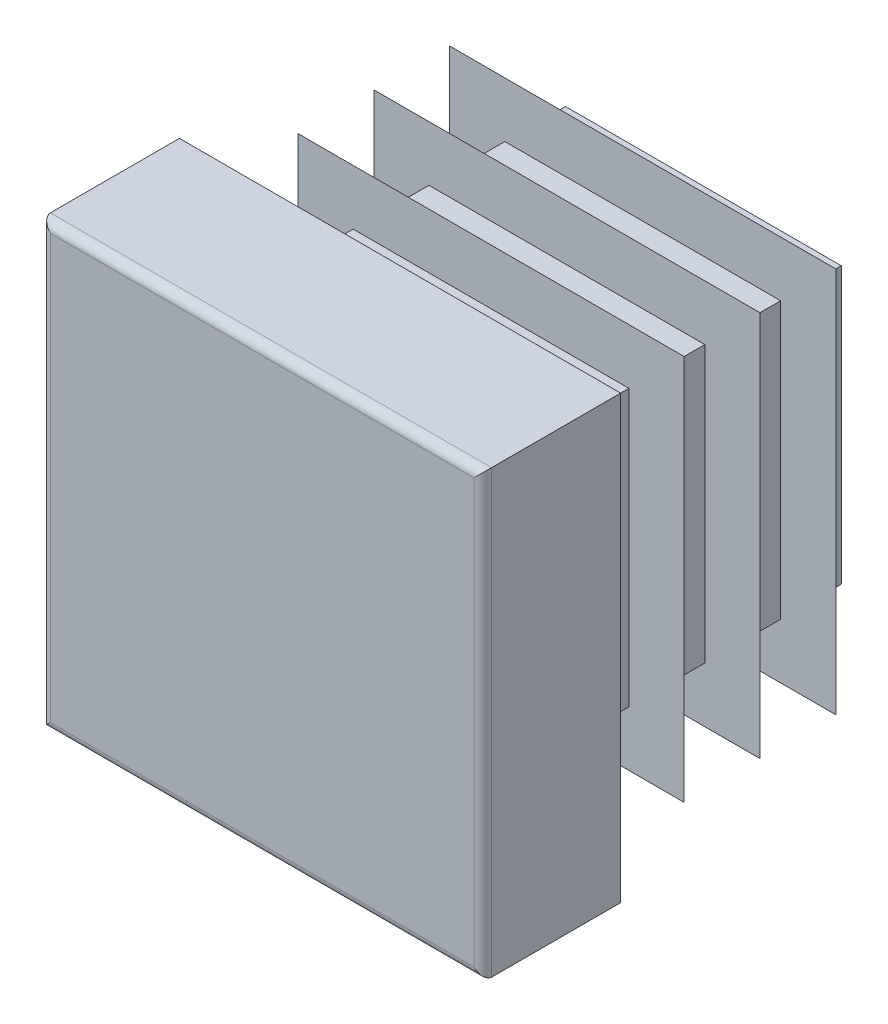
ISO-10303-21;
HEADER;
FILE_DESCRIPTION(('STEP AP214'),'2;1');
FILE_NAME('part.step','',(''),(''),'','','');
FILE_SCHEMA(('AUTOMOTIVE_DESIGN { 1 0 10303 214 1 1 1 1 }'));
ENDSEC;
DATA;
#1=APPLICATION_CONTEXT('core data for automotive mechanical design processes');
#2=APPLICATION_PROTOCOL_DEFINITION('international standard','automotive_design',2000,#1);
#3=PRODUCT_CONTEXT('',#1,'mechanical');
#4=PRODUCT('Part','Part','',(#3));
#5=PRODUCT_RELATED_PRODUCT_CATEGORY('part','',(#4));
#6=PRODUCT_DEFINITION_FORMATION('','',#4);
#7=PRODUCT_DEFINITION_CONTEXT('part definition',#1,'design');
#8=PRODUCT_DEFINITION('design','',#6,#7);
#9=PRODUCT_DEFINITION_SHAPE('','',#8);
#10=(LENGTH_UNIT() NAMED_UNIT(*) SI_UNIT(.MILLI.,.METRE.));
#11=(NAMED_UNIT(*) PLANE_ANGLE_UNIT() SI_UNIT($,.RADIAN.));
#12=(NAMED_UNIT(*) SI_UNIT($,.STERADIAN.) SOLID_ANGLE_UNIT());
#13=UNCERTAINTY_MEASURE_WITH_UNIT(LENGTH_MEASURE(1.E-05),#10,'distance_accuracy_value','');
#14=(GEOMETRIC_REPRESENTATION_CONTEXT(3) GLOBAL_UNCERTAINTY_ASSIGNED_CONTEXT((#13)) GLOBAL_UNIT_ASSIGNED_CONTEXT((#10,
#11,#12)) REPRESENTATION_CONTEXT('',''));
#15=CARTESIAN_POINT('',(0.,0.,0.));
#16=DIRECTION('',(0.,0.,1.));
#17=DIRECTION('',(1.,0.,0.));
#18=AXIS2_PLACEMENT_3D('',#15,#16,#17);
#19=CARTESIAN_POINT('',(7.68,-8.,5.));
#20=DIRECTION('',(0.,0.,-1.));
#21=DIRECTION('',(0.,1.,0.));
#22=AXIS2_PLACEMENT_3D('',#19,#20,#21);
#23=PLANE('',#22);
#24=DIRECTION('',(0.,1.,0.));
#25=VECTOR('',#24,1.);
#26=CARTESIAN_POINT('',(-7.68,-8.,5.));
#27=LINE('',#26,#25);
#28=CARTESIAN_POINT('',(-7.68,-7.68,5.));
#29=VERTEX_POINT('',#28);
#30=CARTESIAN_POINT('',(-7.68,7.68,5.));
#31=VERTEX_POINT('',#30);
#32=EDGE_CURVE('E262',#29,#31,#27,.T.);
#33=ORIENTED_EDGE('',*,*,#32,.F.);
#34=DIRECTION('',(-1.,0.,0.));
#35=VECTOR('',#34,1.);
#36=CARTESIAN_POINT('',(8.,-7.68,5.));
#37=LINE('',#36,#35);
#38=CARTESIAN_POINT('',(7.68,-7.68,5.));
#39=VERTEX_POINT('',#38);
#40=EDGE_CURVE('E432',#39,#29,#37,.T.);
#41=ORIENTED_EDGE('',*,*,#40,.F.);
#42=DIRECTION('',(0.,1.,0.));
#43=VECTOR('',#42,1.);
#44=CARTESIAN_POINT('',(7.68,-8.,5.));
#45=LINE('',#44,#43);
#46=CARTESIAN_POINT('',(7.68,7.68,5.));
#47=VERTEX_POINT('',#46);
#48=EDGE_CURVE('E257',#39,#47,#45,.T.);
#49=ORIENTED_EDGE('',*,*,#48,.T.);
#50=DIRECTION('',(-1.,0.,0.));
#51=VECTOR('',#50,1.);
#52=CARTESIAN_POINT('',(8.,7.68,5.));
#53=LINE('',#52,#51);
#54=EDGE_CURVE('E534',#47,#31,#53,.T.);
#55=ORIENTED_EDGE('',*,*,#54,.T.);
#56=EDGE_LOOP('',(#33,#41,#49,#55));
#57=FACE_BOUND('',#56,.T.);
#58=ADVANCED_FACE('F14',(#57),#23,.F.);
#59=CARTESIAN_POINT('',(-7.68,-8.,4.68));
#60=DIRECTION('',(0.,1.,0.));
#61=DIRECTION('',(-1.,0.,0.));
#62=AXIS2_PLACEMENT_3D('',#59,#60,#61);
#63=CYLINDRICAL_SURFACE('',#62,0.32);
#64=DIRECTION('',(0.,1.,0.));
#65=VECTOR('',#64,1.);
#66=CARTESIAN_POINT('',(-8.,-8.,4.68));
#67=LINE('',#66,#65);
#68=CARTESIAN_POINT('',(-8.,-8.,4.68));
#69=VERTEX_POINT('',#68);
#70=CARTESIAN_POINT('',(-8.,8.,4.68));
#71=VERTEX_POINT('',#70);
#72=EDGE_CURVE('E354',#69,#71,#67,.T.);
#73=ORIENTED_EDGE('',*,*,#72,.F.);
#74=CARTESIAN_POINT('',(-7.68,-7.68,4.68));
#75=DIRECTION('',(-0.707106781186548,0.707106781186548,0.));
#76=DIRECTION('',(0.707106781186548,0.707106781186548,0.));
#77=AXIS2_PLACEMENT_3D('',#74,#75,#76);
#78=ELLIPSE('',#77,0.452548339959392,0.32);
#79=EDGE_CURVE('E59',#69,#29,#78,.T.);
#80=ORIENTED_EDGE('',*,*,#79,.T.);
#81=ORIENTED_EDGE('',*,*,#32,.T.);
#82=CARTESIAN_POINT('',(-7.68,7.68,4.68));
#83=DIRECTION('',(0.707106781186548,0.707106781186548,0.));
#84=DIRECTION('',(-0.707106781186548,0.707106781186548,0.));
#85=AXIS2_PLACEMENT_3D('',#82,#83,#84);
#86=ELLIPSE('',#85,0.452548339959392,0.32);
#87=EDGE_CURVE('E258',#31,#71,#86,.F.);
#88=ORIENTED_EDGE('',*,*,#87,.T.);
#89=EDGE_LOOP('',(#73,#80,#81,#88));
#90=FACE_BOUND('',#89,.T.);
#91=ADVANCED_FACE('F16',(#90),#63,.T.);
#92=CARTESIAN_POINT('',(-8.,-8.,4.68));
#93=DIRECTION('',(1.,0.,0.));
#94=DIRECTION('',(0.,1.,0.));
#95=AXIS2_PLACEMENT_3D('',#92,#93,#94);
#96=PLANE('',#95);
#97=DIRECTION('',(0.,0.,-1.));
#98=VECTOR('',#97,1.);
#99=CARTESIAN_POINT('',(-8.,8.,4.68));
#100=LINE('',#99,#98);
#101=CARTESIAN_POINT('',(-8.,8.,0.));
#102=VERTEX_POINT('',#101);
#103=EDGE_CURVE('E519',#71,#102,#100,.T.);
#104=ORIENTED_EDGE('',*,*,#103,.T.);
#105=DIRECTION('',(0.,1.,0.));
#106=VECTOR('',#105,1.);
#107=CARTESIAN_POINT('',(-8.,-8.,0.));
#108=LINE('',#107,#106);
#109=CARTESIAN_POINT('',(-8.,-8.,0.));
#110=VERTEX_POINT('',#109);
#111=EDGE_CURVE('E352',#110,#102,#108,.T.);
#112=ORIENTED_EDGE('',*,*,#111,.F.);
#113=DIRECTION('',(0.,0.,-1.));
#114=VECTOR('',#113,1.);
#115=CARTESIAN_POINT('',(-8.,-8.,4.68));
#116=LINE('',#115,#114);
#117=EDGE_CURVE('E520',#69,#110,#116,.T.);
#118=ORIENTED_EDGE('',*,*,#117,.F.);
#119=ORIENTED_EDGE('',*,*,#72,.T.);
#120=EDGE_LOOP('',(#104,#112,#118,#119));
#121=FACE_BOUND('',#120,.T.);
#122=ADVANCED_FACE('F604',(#121),#96,.F.);
#123=CARTESIAN_POINT('',(-5.,-8.,0.));
#124=DIRECTION('',(1.,0.,0.));
#125=DIRECTION('',(0.,1.,0.));
#126=AXIS2_PLACEMENT_3D('',#123,#124,#125);
#127=PLANE('',#126);
#128=DIRECTION('',(0.,1.,0.));
#129=VECTOR('',#128,1.);
#130=CARTESIAN_POINT('',(-5.,-8.,0.));
#131=LINE('',#130,#129);
#132=CARTESIAN_POINT('',(-5.,-5.,0.));
#133=VERTEX_POINT('',#132);
#134=CARTESIAN_POINT('',(-5.,5.,0.));
#135=VERTEX_POINT('',#134);
#136=EDGE_CURVE('E349',#133,#135,#131,.T.);
#137=ORIENTED_EDGE('',*,*,#136,.T.);
#138=DIRECTION('',(0.,0.,-1.));
#139=VECTOR('',#138,1.);
#140=CARTESIAN_POINT('',(-5.,5.,0.));
#141=LINE('',#140,#139);
#142=CARTESIAN_POINT('',(-5.,5.,-0.55));
#143=VERTEX_POINT('',#142);
#144=EDGE_CURVE('E445',#135,#143,#141,.T.);
#145=ORIENTED_EDGE('',*,*,#144,.T.);
#146=DIRECTION('',(0.,1.,0.));
#147=VECTOR('',#146,1.);
#148=CARTESIAN_POINT('',(-5.,-8.,-0.55));
#149=LINE('',#148,#147);
#150=CARTESIAN_POINT('',(-5.,-5.,-0.55));
#151=VERTEX_POINT('',#150);
#152=EDGE_CURVE('E346',#151,#143,#149,.T.);
#153=ORIENTED_EDGE('',*,*,#152,.F.);
#154=DIRECTION('',(0.,0.,1.));
#155=VECTOR('',#154,1.);
#156=CARTESIAN_POINT('',(-5.,-5.,0.));
#157=LINE('',#156,#155);
#158=EDGE_CURVE('E439',#151,#133,#157,.T.);
#159=ORIENTED_EDGE('',*,*,#158,.T.);
#160=EDGE_LOOP('',(#137,#145,#153,#159));
#161=FACE_BOUND('',#160,.T.);
#162=ADVANCED_FACE('F728',(#161),#127,.F.);
#163=CARTESIAN_POINT('',(-7.,-8.,-0.55));
#164=DIRECTION('',(0.573576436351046,0.,0.819152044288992));
#165=DIRECTION('',(-0.819152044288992,0.,0.573576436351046));
#166=AXIS2_PLACEMENT_3D('',#163,#164,#165);
#167=PLANE('',#166);
#168=DIRECTION('',(0.,1.,0.));
#169=VECTOR('',#168,1.);
#170=CARTESIAN_POINT('',(-7.,-8.,-0.55));
#171=LINE('',#170,#169);
#172=CARTESIAN_POINT('',(-7.,-7.,-0.55));
#173=VERTEX_POINT('',#172);
#174=CARTESIAN_POINT('',(-7.,7.,-0.55));
#175=VERTEX_POINT('',#174);
#176=EDGE_CURVE('E344',#173,#175,#171,.T.);
#177=ORIENTED_EDGE('',*,*,#176,.T.);
#178=DIRECTION('',(0.633687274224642,-0.633687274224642,-0.443712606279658));
#179=VECTOR('',#178,1.);
#180=CARTESIAN_POINT('',(-0.976606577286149,0.976606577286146,-4.76762548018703));
#181=LINE('',#180,#179);
#182=CARTESIAN_POINT('',(-5.,5.,-1.95041507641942));
#183=VERTEX_POINT('',#182);
#184=EDGE_CURVE('E457',#175,#183,#181,.T.);
#185=ORIENTED_EDGE('',*,*,#184,.T.);
#186=DIRECTION('',(0.,1.,0.));
#187=VECTOR('',#186,1.);
#188=CARTESIAN_POINT('',(-5.,-8.,-1.95041507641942));
#189=LINE('',#188,#187);
#190=CARTESIAN_POINT('',(-5.,-5.,-1.95041507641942));
#191=VERTEX_POINT('',#190);
#192=EDGE_CURVE('E341',#191,#183,#189,.T.);
#193=ORIENTED_EDGE('',*,*,#192,.F.);
#194=DIRECTION('',(-0.633687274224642,-0.633687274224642,0.443712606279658));
#195=VECTOR('',#194,1.);
#196=CARTESIAN_POINT('',(-7.40155956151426,-7.40155956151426,-0.268824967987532));
#197=LINE('',#196,#195);
#198=EDGE_CURVE('E451',#191,#173,#197,.T.);
#199=ORIENTED_EDGE('',*,*,#198,.T.);
#200=EDGE_LOOP('',(#177,#185,#193,#199));
#201=FACE_BOUND('',#200,.T.);
#202=ADVANCED_FACE('F732',(#201),#167,.F.);
#203=CARTESIAN_POINT('',(-5.,-8.,-1.95041507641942));
#204=DIRECTION('',(1.,0.,0.));
#205=DIRECTION('',(0.,1.,0.));
#206=AXIS2_PLACEMENT_3D('',#203,#204,#205);
#207=PLANE('',#206);
#208=ORIENTED_EDGE('',*,*,#192,.T.);
#209=DIRECTION('',(0.,0.,-1.));
#210=VECTOR('',#209,1.);
#211=CARTESIAN_POINT('',(-5.,5.,-1.95041507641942));
#212=LINE('',#211,#210);
#213=CARTESIAN_POINT('',(-5.,5.,-3.3));
#214=VERTEX_POINT('',#213);
#215=EDGE_CURVE('E463',#183,#214,#212,.T.);
#216=ORIENTED_EDGE('',*,*,#215,.T.);
#217=DIRECTION('',(0.,1.,0.));
#218=VECTOR('',#217,1.);
#219=CARTESIAN_POINT('',(-5.,-8.,-3.3));
#220=LINE('',#219,#218);
#221=CARTESIAN_POINT('',(-5.,-5.,-3.3));
#222=VERTEX_POINT('',#221);
#223=EDGE_CURVE('E338',#222,#214,#220,.T.);
#224=ORIENTED_EDGE('',*,*,#223,.F.);
#225=DIRECTION('',(0.,0.,1.));
#226=VECTOR('',#225,1.);
#227=CARTESIAN_POINT('',(-5.,-5.,-1.95041507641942));
#228=LINE('',#227,#226);
#229=EDGE_CURVE('E460',#222,#191,#228,.T.);
#230=ORIENTED_EDGE('',*,*,#229,.T.);
#231=EDGE_LOOP('',(#208,#216,#224,#230));
#232=FACE_BOUND('',#231,.T.);
#233=ADVANCED_FACE('F738',(#232),#207,.F.);
#234=CARTESIAN_POINT('',(-7.,-8.,-3.3));
#235=DIRECTION('',(0.573576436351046,0.,0.819152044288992));
#236=DIRECTION('',(-0.819152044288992,0.,0.573576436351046));
#237=AXIS2_PLACEMENT_3D('',#234,#235,#236);
#238=PLANE('',#237);
#239=DIRECTION('',(0.,1.,0.));
#240=VECTOR('',#239,1.);
#241=CARTESIAN_POINT('',(-7.,-8.,-3.3));
#242=LINE('',#241,#240);
#243=CARTESIAN_POINT('',(-7.,-7.,-3.3));
#244=VERTEX_POINT('',#243);
#245=CARTESIAN_POINT('',(-7.,7.,-3.3));
#246=VERTEX_POINT('',#245);
#247=EDGE_CURVE('E336',#244,#246,#242,.T.);
#248=ORIENTED_EDGE('',*,*,#247,.T.);
#249=DIRECTION('',(0.633687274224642,-0.633687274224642,-0.443712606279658));
#250=VECTOR('',#249,1.);
#251=CARTESIAN_POINT('',(-0.976606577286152,0.976606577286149,-7.51762548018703));
#252=LINE('',#251,#250);
#253=CARTESIAN_POINT('',(-5.,5.,-4.70041507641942));
#254=VERTEX_POINT('',#253);
#255=EDGE_CURVE('E475',#246,#254,#252,.T.);
#256=ORIENTED_EDGE('',*,*,#255,.T.);
#257=DIRECTION('',(0.,1.,0.));
#258=VECTOR('',#257,1.);
#259=CARTESIAN_POINT('',(-5.,-8.,-4.70041507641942));
#260=LINE('',#259,#258);
#261=CARTESIAN_POINT('',(-5.,-5.,-4.70041507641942));
#262=VERTEX_POINT('',#261);
#263=EDGE_CURVE('E333',#262,#254,#260,.T.);
#264=ORIENTED_EDGE('',*,*,#263,.F.);
#265=DIRECTION('',(-0.633687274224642,-0.633687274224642,0.443712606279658));
#266=VECTOR('',#265,1.);
#267=CARTESIAN_POINT('',(-7.40155956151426,-7.40155956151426,-3.01882496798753));
#268=LINE('',#267,#266);
#269=EDGE_CURVE('E469',#262,#244,#268,.T.);
#270=ORIENTED_EDGE('',*,*,#269,.T.);
#271=EDGE_LOOP('',(#248,#256,#264,#270));
#272=FACE_BOUND('',#271,.T.);
#273=ADVANCED_FACE('F742',(#272),#238,.F.);
#274=CARTESIAN_POINT('',(-5.,-8.,-4.70041507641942));
#275=DIRECTION('',(1.,0.,0.));
#276=DIRECTION('',(0.,1.,0.));
#277=AXIS2_PLACEMENT_3D('',#274,#275,#276);
#278=PLANE('',#277);
#279=ORIENTED_EDGE('',*,*,#263,.T.);
#280=DIRECTION('',(0.,0.,-1.));
#281=VECTOR('',#280,1.);
#282=CARTESIAN_POINT('',(-5.,5.,-4.70041507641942));
#283=LINE('',#282,#281);
#284=CARTESIAN_POINT('',(-5.,5.,-6.05));
#285=VERTEX_POINT('',#284);
#286=EDGE_CURVE('E481',#254,#285,#283,.T.);
#287=ORIENTED_EDGE('',*,*,#286,.T.);
#288=DIRECTION('',(0.,1.,0.));
#289=VECTOR('',#288,1.);
#290=CARTESIAN_POINT('',(-5.,-8.,-6.05));
#291=LINE('',#290,#289);
#292=CARTESIAN_POINT('',(-5.,-5.,-6.05));
#293=VERTEX_POINT('',#292);
#294=EDGE_CURVE('E330',#293,#285,#291,.T.);
#295=ORIENTED_EDGE('',*,*,#294,.F.);
#296=DIRECTION('',(0.,0.,1.));
#297=VECTOR('',#296,1.);
#298=CARTESIAN_POINT('',(-5.,-5.,-4.70041507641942));
#299=LINE('',#298,#297);
#300=EDGE_CURVE('E478',#293,#262,#299,.T.);
#301=ORIENTED_EDGE('',*,*,#300,.T.);
#302=EDGE_LOOP('',(#279,#287,#295,#301));
#303=FACE_BOUND('',#302,.T.);
#304=ADVANCED_FACE('F746',(#303),#278,.F.);
#305=CARTESIAN_POINT('',(-7.,-8.,-6.05));
#306=DIRECTION('',(0.573576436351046,0.,0.819152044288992));
#307=DIRECTION('',(-0.819152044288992,0.,0.573576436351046));
#308=AXIS2_PLACEMENT_3D('',#305,#306,#307);
#309=PLANE('',#308);
#310=DIRECTION('',(0.,1.,0.));
#311=VECTOR('',#310,1.);
#312=CARTESIAN_POINT('',(-7.,-8.,-6.05));
#313=LINE('',#312,#311);
#314=CARTESIAN_POINT('',(-7.,-7.,-6.05));
#315=VERTEX_POINT('',#314);
#316=CARTESIAN_POINT('',(-7.,7.,-6.05));
#317=VERTEX_POINT('',#316);
#318=EDGE_CURVE('E328',#315,#317,#313,.T.);
#319=ORIENTED_EDGE('',*,*,#318,.T.);
#320=DIRECTION('',(0.633687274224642,-0.633687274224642,-0.443712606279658));
#321=VECTOR('',#320,1.);
#322=CARTESIAN_POINT('',(-0.97660657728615,0.976606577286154,-10.267625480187));
#323=LINE('',#322,#321);
#324=CARTESIAN_POINT('',(-5.,5.,-7.45041507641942));
#325=VERTEX_POINT('',#324);
#326=EDGE_CURVE('E493',#317,#325,#323,.T.);
#327=ORIENTED_EDGE('',*,*,#326,.T.);
#328=DIRECTION('',(0.,1.,0.));
#329=VECTOR('',#328,1.);
#330=CARTESIAN_POINT('',(-5.,-8.,-7.45041507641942));
#331=LINE('',#330,#329);
#332=CARTESIAN_POINT('',(-5.,-5.,-7.45041507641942));
#333=VERTEX_POINT('',#332);
#334=EDGE_CURVE('E325',#333,#325,#331,.T.);
#335=ORIENTED_EDGE('',*,*,#334,.F.);
#336=DIRECTION('',(-0.633687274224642,-0.633687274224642,0.443712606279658));
#337=VECTOR('',#336,1.);
#338=CARTESIAN_POINT('',(-7.40155956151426,-7.40155956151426,-5.76882496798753));
#339=LINE('',#338,#337);
#340=EDGE_CURVE('E487',#333,#315,#339,.T.);
#341=ORIENTED_EDGE('',*,*,#340,.T.);
#342=EDGE_LOOP('',(#319,#327,#335,#341));
#343=FACE_BOUND('',#342,.T.);
#344=ADVANCED_FACE('F668',(#343),#309,.F.);
#345=CARTESIAN_POINT('',(-5.,-8.,-7.45041507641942));
#346=DIRECTION('',(1.,0.,0.));
#347=DIRECTION('',(0.,1.,0.));
#348=AXIS2_PLACEMENT_3D('',#345,#346,#347);
#349=PLANE('',#348);
#350=ORIENTED_EDGE('',*,*,#334,.T.);
#351=DIRECTION('',(0.,0.,-1.));
#352=VECTOR('',#351,1.);
#353=CARTESIAN_POINT('',(-5.,5.,-7.45041507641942));
#354=LINE('',#353,#352);
#355=CARTESIAN_POINT('',(-5.,5.,-8.8));
#356=VERTEX_POINT('',#355);
#357=EDGE_CURVE('E499',#325,#356,#354,.T.);
#358=ORIENTED_EDGE('',*,*,#357,.T.);
#359=DIRECTION('',(0.,1.,0.));
#360=VECTOR('',#359,1.);
#361=CARTESIAN_POINT('',(-5.,-8.,-8.8));
#362=LINE('',#361,#360);
#363=CARTESIAN_POINT('',(-5.,-5.,-8.8));
#364=VERTEX_POINT('',#363);
#365=EDGE_CURVE('E322',#364,#356,#362,.T.);
#366=ORIENTED_EDGE('',*,*,#365,.F.);
#367=DIRECTION('',(0.,0.,1.));
#368=VECTOR('',#367,1.);
#369=CARTESIAN_POINT('',(-5.,-5.,-7.45041507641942));
#370=LINE('',#369,#368);
#371=EDGE_CURVE('E496',#364,#333,#370,.T.);
#372=ORIENTED_EDGE('',*,*,#371,.T.);
#373=EDGE_LOOP('',(#350,#358,#366,#372));
#374=FACE_BOUND('',#373,.T.);
#375=ADVANCED_FACE('F665',(#374),#349,.F.);
#376=CARTESIAN_POINT('',(-7.,-8.,-8.8));
#377=DIRECTION('',(0.573576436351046,0.,0.819152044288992));
#378=DIRECTION('',(-0.819152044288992,0.,0.573576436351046));
#379=AXIS2_PLACEMENT_3D('',#376,#377,#378);
#380=PLANE('',#379);
#381=DIRECTION('',(0.,1.,0.));
#382=VECTOR('',#381,1.);
#383=CARTESIAN_POINT('',(-7.,-8.,-8.8));
#384=LINE('',#383,#382);
#385=CARTESIAN_POINT('',(-7.,-7.,-8.8));
#386=VERTEX_POINT('',#385);
#387=CARTESIAN_POINT('',(-7.,7.,-8.8));
#388=VERTEX_POINT('',#387);
#389=EDGE_CURVE('E320',#386,#388,#384,.T.);
#390=ORIENTED_EDGE('',*,*,#389,.T.);
#391=DIRECTION('',(0.633687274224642,-0.633687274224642,-0.443712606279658));
#392=VECTOR('',#391,1.);
#393=CARTESIAN_POINT('',(-0.97660657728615,0.976606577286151,-13.017625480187));
#394=LINE('',#393,#392);
#395=CARTESIAN_POINT('',(-5.,5.,-10.2004150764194));
#396=VERTEX_POINT('',#395);
#397=EDGE_CURVE('E511',#388,#396,#394,.T.);
#398=ORIENTED_EDGE('',*,*,#397,.T.);
#399=DIRECTION('',(0.,1.,0.));
#400=VECTOR('',#399,1.);
#401=CARTESIAN_POINT('',(-5.,-8.,-10.2004150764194));
#402=LINE('',#401,#400);
#403=CARTESIAN_POINT('',(-5.,-5.,-10.2004150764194));
#404=VERTEX_POINT('',#403);
#405=EDGE_CURVE('E317',#404,#396,#402,.T.);
#406=ORIENTED_EDGE('',*,*,#405,.F.);
#407=DIRECTION('',(-0.633687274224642,-0.633687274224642,0.443712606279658));
#408=VECTOR('',#407,1.);
#409=CARTESIAN_POINT('',(-7.40155956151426,-7.40155956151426,-8.51882496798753));
#410=LINE('',#409,#408);
#411=EDGE_CURVE('E505',#404,#386,#410,.T.);
#412=ORIENTED_EDGE('',*,*,#411,.T.);
#413=EDGE_LOOP('',(#390,#398,#406,#412));
#414=FACE_BOUND('',#413,.T.);
#415=ADVANCED_FACE('F580',(#414),#380,.F.);
#416=CARTESIAN_POINT('',(-5.,-8.,-10.2004150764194));
#417=DIRECTION('',(1.,0.,0.));
#418=DIRECTION('',(0.,1.,0.));
#419=AXIS2_PLACEMENT_3D('',#416,#417,#418);
#420=PLANE('',#419);
#421=ORIENTED_EDGE('',*,*,#405,.T.);
#422=DIRECTION('',(0.,0.,-1.));
#423=VECTOR('',#422,1.);
#424=CARTESIAN_POINT('',(-5.,5.,-10.2004150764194));
#425=LINE('',#424,#423);
#426=CARTESIAN_POINT('',(-5.,5.,-11.));
#427=VERTEX_POINT('',#426);
#428=EDGE_CURVE('E517',#396,#427,#425,.T.);
#429=ORIENTED_EDGE('',*,*,#428,.T.);
#430=DIRECTION('',(0.,1.,0.));
#431=VECTOR('',#430,1.);
#432=CARTESIAN_POINT('',(-5.,-8.,-11.));
#433=LINE('',#432,#431);
#434=CARTESIAN_POINT('',(-5.,-5.,-11.));
#435=VERTEX_POINT('',#434);
#436=EDGE_CURVE('E314',#435,#427,#433,.T.);
#437=ORIENTED_EDGE('',*,*,#436,.F.);
#438=DIRECTION('',(0.,0.,1.));
#439=VECTOR('',#438,1.);
#440=CARTESIAN_POINT('',(-5.,-5.,-10.2004150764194));
#441=LINE('',#440,#439);
#442=EDGE_CURVE('E514',#435,#404,#441,.T.);
#443=ORIENTED_EDGE('',*,*,#442,.T.);
#444=EDGE_LOOP('',(#421,#429,#437,#443));
#445=FACE_BOUND('',#444,.T.);
#446=ADVANCED_FACE('F582',(#445),#420,.F.);
#447=CARTESIAN_POINT('',(-5.,-8.,-11.));
#448=DIRECTION('',(0.,0.,1.));
#449=DIRECTION('',(0.,-1.,0.));
#450=AXIS2_PLACEMENT_3D('',#447,#448,#449);
#451=PLANE('',#450);
#452=ORIENTED_EDGE('',*,*,#436,.T.);
#453=DIRECTION('',(-1.,0.,0.));
#454=VECTOR('',#453,1.);
#455=CARTESIAN_POINT('',(8.,5.,-11.));
#456=LINE('',#455,#454);
#457=CARTESIAN_POINT('',(5.,5.,-11.));
#458=VERTEX_POINT('',#457);
#459=EDGE_CURVE('E388',#458,#427,#456,.T.);
#460=ORIENTED_EDGE('',*,*,#459,.F.);
#461=DIRECTION('',(0.,1.,0.));
#462=VECTOR('',#461,1.);
#463=CARTESIAN_POINT('',(5.,-8.,-11.));
#464=LINE('',#463,#462);
#465=CARTESIAN_POINT('',(5.,-5.,-11.));
#466=VERTEX_POINT('',#465);
#467=EDGE_CURVE('E311',#466,#458,#464,.T.);
#468=ORIENTED_EDGE('',*,*,#467,.F.);
#469=DIRECTION('',(-1.,0.,0.));
#470=VECTOR('',#469,1.);
#471=CARTESIAN_POINT('',(8.,-5.,-11.));
#472=LINE('',#471,#470);
#473=EDGE_CURVE('E386',#466,#435,#472,.T.);
#474=ORIENTED_EDGE('',*,*,#473,.T.);
#475=EDGE_LOOP('',(#452,#460,#468,#474));
#476=FACE_BOUND('',#475,.T.);
#477=ADVANCED_FACE('F385',(#476),#451,.F.);
#478=CARTESIAN_POINT('',(5.,-8.,-11.));
#479=DIRECTION('',(-1.,0.,0.));
#480=DIRECTION('',(0.,-1.,0.));
#481=AXIS2_PLACEMENT_3D('',#478,#479,#480);
#482=PLANE('',#481);
#483=ORIENTED_EDGE('',*,*,#467,.T.);
#484=DIRECTION('',(0.,0.,1.));
#485=VECTOR('',#484,1.);
#486=CARTESIAN_POINT('',(5.,5.,-11.));
#487=LINE('',#486,#485);
#488=CARTESIAN_POINT('',(5.,5.,-10.2004150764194));
#489=VERTEX_POINT('',#488);
#490=EDGE_CURVE('E9',#458,#489,#487,.T.);
#491=ORIENTED_EDGE('',*,*,#490,.T.);
#492=DIRECTION('',(0.,1.,0.));
#493=VECTOR('',#492,1.);
#494=CARTESIAN_POINT('',(5.,-8.,-10.2004150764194));
#495=LINE('',#494,#493);
#496=CARTESIAN_POINT('',(5.,-5.,-10.2004150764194));
#497=VERTEX_POINT('',#496);
#498=EDGE_CURVE('E308',#497,#489,#495,.T.);
#499=ORIENTED_EDGE('',*,*,#498,.F.);
#500=DIRECTION('',(0.,0.,-1.));
#501=VECTOR('',#500,1.);
#502=CARTESIAN_POINT('',(5.,-5.,-11.));
#503=LINE('',#502,#501);
#504=EDGE_CURVE('E23',#497,#466,#503,.T.);
#505=ORIENTED_EDGE('',*,*,#504,.T.);
#506=EDGE_LOOP('',(#483,#491,#499,#505));
#507=FACE_BOUND('',#506,.T.);
#508=ADVANCED_FACE('F378',(#507),#482,.F.);
#509=CARTESIAN_POINT('',(5.,-8.,-10.2004150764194));
#510=DIRECTION('',(-0.573576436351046,0.,0.819152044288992));
#511=DIRECTION('',(-0.819152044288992,0.,-0.573576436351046));
#512=AXIS2_PLACEMENT_3D('',#509,#510,#511);
#513=PLANE('',#512);
#514=ORIENTED_EDGE('',*,*,#498,.T.);
#515=DIRECTION('',(0.633687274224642,0.633687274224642,0.443712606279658));
#516=VECTOR('',#515,1.);
#517=CARTESIAN_POINT('',(-0.220274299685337,-0.220274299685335,-13.8556904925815));
#518=LINE('',#517,#516);
#519=CARTESIAN_POINT('',(7.,7.,-8.8));
#520=VERTEX_POINT('',#519);
#521=EDGE_CURVE('E508',#489,#520,#518,.T.);
#522=ORIENTED_EDGE('',*,*,#521,.T.);
#523=DIRECTION('',(0.,1.,0.));
#524=VECTOR('',#523,1.);
#525=CARTESIAN_POINT('',(7.,-8.,-8.8));
#526=LINE('',#525,#524);
#527=CARTESIAN_POINT('',(7.,-7.,-8.8));
#528=VERTEX_POINT('',#527);
#529=EDGE_CURVE('E305',#528,#520,#526,.T.);
#530=ORIENTED_EDGE('',*,*,#529,.F.);
#531=DIRECTION('',(-0.633687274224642,0.633687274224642,-0.443712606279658));
#532=VECTOR('',#531,1.);
#533=CARTESIAN_POINT('',(6.20467868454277,-6.20467868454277,-9.35688998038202));
#534=LINE('',#533,#532);
#535=EDGE_CURVE('E502',#528,#497,#534,.T.);
#536=ORIENTED_EDGE('',*,*,#535,.T.);
#537=EDGE_LOOP('',(#514,#522,#530,#536));
#538=FACE_BOUND('',#537,.T.);
#539=ADVANCED_FACE('F588',(#538),#513,.F.);
#540=CARTESIAN_POINT('',(7.,-8.,-8.8));
#541=DIRECTION('',(0.,0.,-1.));
#542=DIRECTION('',(0.,1.,0.));
#543=AXIS2_PLACEMENT_3D('',#540,#541,#542);
#544=PLANE('',#543);
#545=ORIENTED_EDGE('',*,*,#529,.T.);
#546=DIRECTION('',(-1.,0.,0.));
#547=VECTOR('',#546,1.);
#548=CARTESIAN_POINT('',(8.,7.,-8.8));
#549=LINE('',#548,#547);
#550=EDGE_CURVE('E394',#520,#388,#549,.T.);
#551=ORIENTED_EDGE('',*,*,#550,.T.);
#552=ORIENTED_EDGE('',*,*,#389,.F.);
#553=DIRECTION('',(-1.,0.,0.));
#554=VECTOR('',#553,1.);
#555=CARTESIAN_POINT('',(8.,-7.,-8.8));
#556=LINE('',#555,#554);
#557=EDGE_CURVE('E401',#528,#386,#556,.T.);
#558=ORIENTED_EDGE('',*,*,#557,.F.);
#559=EDGE_LOOP('',(#545,#551,#552,#558));
#560=FACE_BOUND('',#559,.T.);
#561=ORIENTED_EDGE('',*,*,#365,.T.);
#562=DIRECTION('',(-1.,0.,0.));
#563=VECTOR('',#562,1.);
#564=CARTESIAN_POINT('',(8.,5.,-8.8));
#565=LINE('',#564,#563);
#566=CARTESIAN_POINT('',(5.,5.,-8.8));
#567=VERTEX_POINT('',#566);
#568=EDGE_CURVE('E567',#567,#356,#565,.T.);
#569=ORIENTED_EDGE('',*,*,#568,.F.);
#570=DIRECTION('',(0.,1.,0.));
#571=VECTOR('',#570,1.);
#572=CARTESIAN_POINT('',(5.,-8.,-8.8));
#573=LINE('',#572,#571);
#574=CARTESIAN_POINT('',(5.,-5.,-8.8));
#575=VERTEX_POINT('',#574);
#576=EDGE_CURVE('E302',#575,#567,#573,.T.);
#577=ORIENTED_EDGE('',*,*,#576,.F.);
#578=DIRECTION('',(-1.,0.,0.));
#579=VECTOR('',#578,1.);
#580=CARTESIAN_POINT('',(8.,-5.,-8.8));
#581=LINE('',#580,#579);
#582=EDGE_CURVE('E403',#575,#364,#581,.T.);
#583=ORIENTED_EDGE('',*,*,#582,.T.);
#584=EDGE_LOOP('',(#561,#569,#577,#583));
#585=FACE_BOUND('',#584,.T.);
#586=ADVANCED_FACE('F571',(#560,#585),#544,.F.);
#587=CARTESIAN_POINT('',(5.,-8.,-8.8));
#588=DIRECTION('',(-1.,0.,0.));
#589=DIRECTION('',(0.,-1.,0.));
#590=AXIS2_PLACEMENT_3D('',#587,#588,#589);
#591=PLANE('',#590);
#592=ORIENTED_EDGE('',*,*,#576,.T.);
#593=DIRECTION('',(0.,0.,1.));
#594=VECTOR('',#593,1.);
#595=CARTESIAN_POINT('',(5.,5.,-8.8));
#596=LINE('',#595,#594);
#597=CARTESIAN_POINT('',(5.,5.,-7.45041507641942));
#598=VERTEX_POINT('',#597);
#599=EDGE_CURVE('E372',#567,#598,#596,.T.);
#600=ORIENTED_EDGE('',*,*,#599,.T.);
#601=DIRECTION('',(0.,1.,0.));
#602=VECTOR('',#601,1.);
#603=CARTESIAN_POINT('',(5.,-8.,-7.45041507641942));
#604=LINE('',#603,#602);
#605=CARTESIAN_POINT('',(5.,-5.,-7.45041507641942));
#606=VERTEX_POINT('',#605);
#607=EDGE_CURVE('E299',#606,#598,#604,.T.);
#608=ORIENTED_EDGE('',*,*,#607,.F.);
#609=DIRECTION('',(0.,0.,-1.));
#610=VECTOR('',#609,1.);
#611=CARTESIAN_POINT('',(5.,-5.,-8.8));
#612=LINE('',#611,#610);
#613=EDGE_CURVE('E369',#606,#575,#612,.T.);
#614=ORIENTED_EDGE('',*,*,#613,.T.);
#615=EDGE_LOOP('',(#592,#600,#608,#614));
#616=FACE_BOUND('',#615,.T.);
#617=ADVANCED_FACE('F596',(#616),#591,.F.);
#618=CARTESIAN_POINT('',(5.,-8.,-7.45041507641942));
#619=DIRECTION('',(-0.573576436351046,0.,0.819152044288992));
#620=DIRECTION('',(-0.819152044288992,0.,-0.573576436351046));
#621=AXIS2_PLACEMENT_3D('',#618,#619,#620);
#622=PLANE('',#621);
#623=ORIENTED_EDGE('',*,*,#607,.T.);
#624=DIRECTION('',(0.633687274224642,0.633687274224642,0.443712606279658));
#625=VECTOR('',#624,1.);
#626=CARTESIAN_POINT('',(-0.220274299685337,-0.220274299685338,-11.1056904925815));
#627=LINE('',#626,#625);
#628=CARTESIAN_POINT('',(7.,7.,-6.05));
#629=VERTEX_POINT('',#628);
#630=EDGE_CURVE('E490',#598,#629,#627,.T.);
#631=ORIENTED_EDGE('',*,*,#630,.T.);
#632=DIRECTION('',(0.,1.,0.));
#633=VECTOR('',#632,1.);
#634=CARTESIAN_POINT('',(7.,-8.,-6.05));
#635=LINE('',#634,#633);
#636=CARTESIAN_POINT('',(7.,-7.,-6.05));
#637=VERTEX_POINT('',#636);
#638=EDGE_CURVE('E296',#637,#629,#635,.T.);
#639=ORIENTED_EDGE('',*,*,#638,.F.);
#640=DIRECTION('',(-0.633687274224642,0.633687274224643,-0.443712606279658));
#641=VECTOR('',#640,1.);
#642=CARTESIAN_POINT('',(6.20467868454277,-6.20467868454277,-6.60688998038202));
#643=LINE('',#642,#641);
#644=EDGE_CURVE('E484',#637,#606,#643,.T.);
#645=ORIENTED_EDGE('',*,*,#644,.T.);
#646=EDGE_LOOP('',(#623,#631,#639,#645));
#647=FACE_BOUND('',#646,.T.);
#648=ADVANCED_FACE('F648',(#647),#622,.F.);
#649=CARTESIAN_POINT('',(7.,-8.,-6.05));
#650=DIRECTION('',(0.,0.,-1.));
#651=DIRECTION('',(0.,1.,0.));
#652=AXIS2_PLACEMENT_3D('',#649,#650,#651);
#653=PLANE('',#652);
#654=ORIENTED_EDGE('',*,*,#638,.T.);
#655=DIRECTION('',(-1.,0.,0.));
#656=VECTOR('',#655,1.);
#657=CARTESIAN_POINT('',(8.,7.,-6.05));
#658=LINE('',#657,#656);
#659=EDGE_CURVE('E561',#629,#317,#658,.T.);
#660=ORIENTED_EDGE('',*,*,#659,.T.);
#661=ORIENTED_EDGE('',*,*,#318,.F.);
#662=DIRECTION('',(-1.,0.,0.));
#663=VECTOR('',#662,1.);
#664=CARTESIAN_POINT('',(8.,-7.,-6.05));
#665=LINE('',#664,#663);
#666=EDGE_CURVE('E409',#637,#315,#665,.T.);
#667=ORIENTED_EDGE('',*,*,#666,.F.);
#668=EDGE_LOOP('',(#654,#660,#661,#667));
#669=FACE_BOUND('',#668,.T.);
#670=ORIENTED_EDGE('',*,*,#294,.T.);
#671=DIRECTION('',(-1.,0.,0.));
#672=VECTOR('',#671,1.);
#673=CARTESIAN_POINT('',(8.,5.,-6.05));
#674=LINE('',#673,#672);
#675=CARTESIAN_POINT('',(5.,5.,-6.05));
#676=VERTEX_POINT('',#675);
#677=EDGE_CURVE('E559',#676,#285,#674,.T.);
#678=ORIENTED_EDGE('',*,*,#677,.F.);
#679=DIRECTION('',(0.,1.,0.));
#680=VECTOR('',#679,1.);
#681=CARTESIAN_POINT('',(5.,-8.,-6.05));
#682=LINE('',#681,#680);
#683=CARTESIAN_POINT('',(5.,-5.,-6.05));
#684=VERTEX_POINT('',#683);
#685=EDGE_CURVE('E293',#684,#676,#682,.T.);
#686=ORIENTED_EDGE('',*,*,#685,.F.);
#687=DIRECTION('',(-1.,0.,0.));
#688=VECTOR('',#687,1.);
#689=CARTESIAN_POINT('',(8.,-5.,-6.05));
#690=LINE('',#689,#688);
#691=EDGE_CURVE('E411',#684,#293,#690,.T.);
#692=ORIENTED_EDGE('',*,*,#691,.T.);
#693=EDGE_LOOP('',(#670,#678,#686,#692));
#694=FACE_BOUND('',#693,.T.);
#695=ADVANCED_FACE('F644',(#669,#694),#653,.F.);
#696=CARTESIAN_POINT('',(5.,-8.,-6.05));
#697=DIRECTION('',(-1.,0.,0.));
#698=DIRECTION('',(0.,-1.,0.));
#699=AXIS2_PLACEMENT_3D('',#696,#697,#698);
#700=PLANE('',#699);
#701=ORIENTED_EDGE('',*,*,#685,.T.);
#702=DIRECTION('',(0.,0.,1.));
#703=VECTOR('',#702,1.);
#704=CARTESIAN_POINT('',(5.,5.,-6.05));
#705=LINE('',#704,#703);
#706=CARTESIAN_POINT('',(5.,5.,-4.70041507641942));
#707=VERTEX_POINT('',#706);
#708=EDGE_CURVE('E366',#676,#707,#705,.T.);
#709=ORIENTED_EDGE('',*,*,#708,.T.);
#710=DIRECTION('',(0.,1.,0.));
#711=VECTOR('',#710,1.);
#712=CARTESIAN_POINT('',(5.,-8.,-4.70041507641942));
#713=LINE('',#712,#711);
#714=CARTESIAN_POINT('',(5.,-5.,-4.70041507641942));
#715=VERTEX_POINT('',#714);
#716=EDGE_CURVE('E290',#715,#707,#713,.T.);
#717=ORIENTED_EDGE('',*,*,#716,.F.);
#718=DIRECTION('',(0.,0.,-1.));
#719=VECTOR('',#718,1.);
#720=CARTESIAN_POINT('',(5.,-5.,-6.05));
#721=LINE('',#720,#719);
#722=EDGE_CURVE('E363',#715,#684,#721,.T.);
#723=ORIENTED_EDGE('',*,*,#722,.T.);
#724=EDGE_LOOP('',(#701,#709,#717,#723));
#725=FACE_BOUND('',#724,.T.);
#726=ADVANCED_FACE('F640',(#725),#700,.F.);
#727=CARTESIAN_POINT('',(5.,-8.,-4.70041507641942));
#728=DIRECTION('',(-0.573576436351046,0.,0.819152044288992));
#729=DIRECTION('',(-0.819152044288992,0.,-0.573576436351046));
#730=AXIS2_PLACEMENT_3D('',#727,#728,#729);
#731=PLANE('',#730);
#732=ORIENTED_EDGE('',*,*,#716,.T.);
#733=DIRECTION('',(0.633687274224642,0.633687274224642,0.443712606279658));
#734=VECTOR('',#733,1.);
#735=CARTESIAN_POINT('',(-0.220274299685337,-0.220274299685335,-8.35569049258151));
#736=LINE('',#735,#734);
#737=CARTESIAN_POINT('',(7.,7.,-3.3));
#738=VERTEX_POINT('',#737);
#739=EDGE_CURVE('E472',#707,#738,#736,.T.);
#740=ORIENTED_EDGE('',*,*,#739,.T.);
#741=DIRECTION('',(0.,1.,0.));
#742=VECTOR('',#741,1.);
#743=CARTESIAN_POINT('',(7.,-8.,-3.3));
#744=LINE('',#743,#742);
#745=CARTESIAN_POINT('',(7.,-7.,-3.3));
#746=VERTEX_POINT('',#745);
#747=EDGE_CURVE('E287',#746,#738,#744,.T.);
#748=ORIENTED_EDGE('',*,*,#747,.F.);
#749=DIRECTION('',(-0.633687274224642,0.633687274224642,-0.443712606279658));
#750=VECTOR('',#749,1.);
#751=CARTESIAN_POINT('',(6.20467868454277,-6.20467868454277,-3.85688998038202));
#752=LINE('',#751,#750);
#753=EDGE_CURVE('E466',#746,#715,#752,.T.);
#754=ORIENTED_EDGE('',*,*,#753,.T.);
#755=EDGE_LOOP('',(#732,#740,#748,#754));
#756=FACE_BOUND('',#755,.T.);
#757=ADVANCED_FACE('F636',(#756),#731,.F.);
#758=CARTESIAN_POINT('',(7.,-8.,-3.3));
#759=DIRECTION('',(0.,0.,-1.));
#760=DIRECTION('',(0.,1.,0.));
#761=AXIS2_PLACEMENT_3D('',#758,#759,#760);
#762=PLANE('',#761);
#763=ORIENTED_EDGE('',*,*,#747,.T.);
#764=DIRECTION('',(-1.,0.,0.));
#765=VECTOR('',#764,1.);
#766=CARTESIAN_POINT('',(8.,7.,-3.3));
#767=LINE('',#766,#765);
#768=EDGE_CURVE('E553',#738,#246,#767,.T.);
#769=ORIENTED_EDGE('',*,*,#768,.T.);
#770=ORIENTED_EDGE('',*,*,#247,.F.);
#771=DIRECTION('',(-1.,0.,0.));
#772=VECTOR('',#771,1.);
#773=CARTESIAN_POINT('',(8.,-7.,-3.3));
#774=LINE('',#773,#772);
#775=EDGE_CURVE('E417',#746,#244,#774,.T.);
#776=ORIENTED_EDGE('',*,*,#775,.F.);
#777=EDGE_LOOP('',(#763,#769,#770,#776));
#778=FACE_BOUND('',#777,.T.);
#779=ORIENTED_EDGE('',*,*,#223,.T.);
#780=DIRECTION('',(-1.,0.,0.));
#781=VECTOR('',#780,1.);
#782=CARTESIAN_POINT('',(8.,5.,-3.3));
#783=LINE('',#782,#781);
#784=CARTESIAN_POINT('',(5.,5.,-3.3));
#785=VERTEX_POINT('',#784);
#786=EDGE_CURVE('E551',#785,#214,#783,.T.);
#787=ORIENTED_EDGE('',*,*,#786,.F.);
#788=DIRECTION('',(0.,1.,0.));
#789=VECTOR('',#788,1.);
#790=CARTESIAN_POINT('',(5.,-8.,-3.3));
#791=LINE('',#790,#789);
#792=CARTESIAN_POINT('',(5.,-5.,-3.3));
#793=VERTEX_POINT('',#792);
#794=EDGE_CURVE('E284',#793,#785,#791,.T.);
#795=ORIENTED_EDGE('',*,*,#794,.F.);
#796=DIRECTION('',(-1.,0.,0.));
#797=VECTOR('',#796,1.);
#798=CARTESIAN_POINT('',(8.,-5.,-3.3));
#799=LINE('',#798,#797);
#800=EDGE_CURVE('E419',#793,#222,#799,.T.);
#801=ORIENTED_EDGE('',*,*,#800,.T.);
#802=EDGE_LOOP('',(#779,#787,#795,#801));
#803=FACE_BOUND('',#802,.T.);
#804=ADVANCED_FACE('F632',(#778,#803),#762,.F.);
#805=CARTESIAN_POINT('',(5.,-8.,-3.3));
#806=DIRECTION('',(-1.,0.,0.));
#807=DIRECTION('',(0.,-1.,0.));
#808=AXIS2_PLACEMENT_3D('',#805,#806,#807);
#809=PLANE('',#808);
#810=ORIENTED_EDGE('',*,*,#794,.T.);
#811=DIRECTION('',(0.,0.,1.));
#812=VECTOR('',#811,1.);
#813=CARTESIAN_POINT('',(5.,5.,-3.3));
#814=LINE('',#813,#812);
#815=CARTESIAN_POINT('',(5.,5.,-1.95041507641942));
#816=VERTEX_POINT('',#815);
#817=EDGE_CURVE('E360',#785,#816,#814,.T.);
#818=ORIENTED_EDGE('',*,*,#817,.T.);
#819=DIRECTION('',(0.,1.,0.));
#820=VECTOR('',#819,1.);
#821=CARTESIAN_POINT('',(5.,-8.,-1.95041507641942));
#822=LINE('',#821,#820);
#823=CARTESIAN_POINT('',(5.,-5.,-1.95041507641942));
#824=VERTEX_POINT('',#823);
#825=EDGE_CURVE('E281',#824,#816,#822,.T.);
#826=ORIENTED_EDGE('',*,*,#825,.F.);
#827=DIRECTION('',(0.,0.,-1.));
#828=VECTOR('',#827,1.);
#829=CARTESIAN_POINT('',(5.,-5.,-3.3));
#830=LINE('',#829,#828);
#831=EDGE_CURVE('E357',#824,#793,#830,.T.);
#832=ORIENTED_EDGE('',*,*,#831,.T.);
#833=EDGE_LOOP('',(#810,#818,#826,#832));
#834=FACE_BOUND('',#833,.T.);
#835=ADVANCED_FACE('F628',(#834),#809,.F.);
#836=CARTESIAN_POINT('',(5.,-8.,-1.95041507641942));
#837=DIRECTION('',(-0.573576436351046,0.,0.819152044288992));
#838=DIRECTION('',(-0.819152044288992,0.,-0.573576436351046));
#839=AXIS2_PLACEMENT_3D('',#836,#837,#838);
#840=PLANE('',#839);
#841=ORIENTED_EDGE('',*,*,#825,.T.);
#842=DIRECTION('',(0.633687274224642,0.633687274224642,0.443712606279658));
#843=VECTOR('',#842,1.);
#844=CARTESIAN_POINT('',(-0.220274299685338,-0.220274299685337,-5.60569049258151));
#845=LINE('',#844,#843);
#846=CARTESIAN_POINT('',(7.,7.,-0.55));
#847=VERTEX_POINT('',#846);
#848=EDGE_CURVE('E454',#816,#847,#845,.T.);
#849=ORIENTED_EDGE('',*,*,#848,.T.);
#850=DIRECTION('',(0.,1.,0.));
#851=VECTOR('',#850,1.);
#852=CARTESIAN_POINT('',(7.,-8.,-0.55));
#853=LINE('',#852,#851);
#854=CARTESIAN_POINT('',(7.,-7.,-0.55));
#855=VERTEX_POINT('',#854);
#856=EDGE_CURVE('E278',#855,#847,#853,.T.);
#857=ORIENTED_EDGE('',*,*,#856,.F.);
#858=DIRECTION('',(-0.633687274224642,0.633687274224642,-0.443712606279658));
#859=VECTOR('',#858,1.);
#860=CARTESIAN_POINT('',(6.20467868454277,-6.20467868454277,-1.10688998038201));
#861=LINE('',#860,#859);
#862=EDGE_CURVE('E448',#855,#824,#861,.T.);
#863=ORIENTED_EDGE('',*,*,#862,.T.);
#864=EDGE_LOOP('',(#841,#849,#857,#863));
#865=FACE_BOUND('',#864,.T.);
#866=ADVANCED_FACE('F624',(#865),#840,.F.);
#867=CARTESIAN_POINT('',(7.,-8.,-0.55));
#868=DIRECTION('',(0.,0.,-1.));
#869=DIRECTION('',(0.,1.,0.));
#870=AXIS2_PLACEMENT_3D('',#867,#868,#869);
#871=PLANE('',#870);
#872=ORIENTED_EDGE('',*,*,#856,.T.);
#873=DIRECTION('',(-1.,0.,0.));
#874=VECTOR('',#873,1.);
#875=CARTESIAN_POINT('',(8.,7.,-0.55));
#876=LINE('',#875,#874);
#877=EDGE_CURVE('E545',#847,#175,#876,.T.);
#878=ORIENTED_EDGE('',*,*,#877,.T.);
#879=ORIENTED_EDGE('',*,*,#176,.F.);
#880=DIRECTION('',(-1.,0.,0.));
#881=VECTOR('',#880,1.);
#882=CARTESIAN_POINT('',(8.,-7.,-0.55));
#883=LINE('',#882,#881);
#884=EDGE_CURVE('E425',#855,#173,#883,.T.);
#885=ORIENTED_EDGE('',*,*,#884,.F.);
#886=EDGE_LOOP('',(#872,#878,#879,#885));
#887=FACE_BOUND('',#886,.T.);
#888=ORIENTED_EDGE('',*,*,#152,.T.);
#889=DIRECTION('',(-1.,0.,0.));
#890=VECTOR('',#889,1.);
#891=CARTESIAN_POINT('',(8.,5.,-0.55));
#892=LINE('',#891,#890);
#893=CARTESIAN_POINT('',(5.,5.,-0.55));
#894=VERTEX_POINT('',#893);
#895=EDGE_CURVE('E543',#894,#143,#892,.T.);
#896=ORIENTED_EDGE('',*,*,#895,.F.);
#897=DIRECTION('',(0.,1.,0.));
#898=VECTOR('',#897,1.);
#899=CARTESIAN_POINT('',(5.,-8.,-0.55));
#900=LINE('',#899,#898);
#901=CARTESIAN_POINT('',(5.,-5.,-0.55));
#902=VERTEX_POINT('',#901);
#903=EDGE_CURVE('E275',#902,#894,#900,.T.);
#904=ORIENTED_EDGE('',*,*,#903,.F.);
#905=DIRECTION('',(-1.,0.,0.));
#906=VECTOR('',#905,1.);
#907=CARTESIAN_POINT('',(8.,-5.,-0.55));
#908=LINE('',#907,#906);
#909=EDGE_CURVE('E427',#902,#151,#908,.T.);
#910=ORIENTED_EDGE('',*,*,#909,.T.);
#911=EDGE_LOOP('',(#888,#896,#904,#910));
#912=FACE_BOUND('',#911,.T.);
#913=ADVANCED_FACE('F620',(#887,#912),#871,.F.);
#914=CARTESIAN_POINT('',(5.,-8.,-0.55));
#915=DIRECTION('',(-1.,0.,0.));
#916=DIRECTION('',(0.,-1.,0.));
#917=AXIS2_PLACEMENT_3D('',#914,#915,#916);
#918=PLANE('',#917);
#919=ORIENTED_EDGE('',*,*,#903,.T.);
#920=DIRECTION('',(0.,0.,1.));
#921=VECTOR('',#920,1.);
#922=CARTESIAN_POINT('',(5.,5.,-0.55));
#923=LINE('',#922,#921);
#924=CARTESIAN_POINT('',(5.,5.,0.));
#925=VERTEX_POINT('',#924);
#926=EDGE_CURVE('E442',#894,#925,#923,.T.);
#927=ORIENTED_EDGE('',*,*,#926,.T.);
#928=DIRECTION('',(0.,1.,0.));
#929=VECTOR('',#928,1.);
#930=CARTESIAN_POINT('',(5.,-8.,0.));
#931=LINE('',#930,#929);
#932=CARTESIAN_POINT('',(5.,-5.,0.));
#933=VERTEX_POINT('',#932);
#934=EDGE_CURVE('E268',#933,#925,#931,.T.);
#935=ORIENTED_EDGE('',*,*,#934,.F.);
#936=DIRECTION('',(0.,0.,-1.));
#937=VECTOR('',#936,1.);
#938=CARTESIAN_POINT('',(5.,-5.,-0.55));
#939=LINE('',#938,#937);
#940=EDGE_CURVE('E436',#933,#902,#939,.T.);
#941=ORIENTED_EDGE('',*,*,#940,.T.);
#942=EDGE_LOOP('',(#919,#927,#935,#941));
#943=FACE_BOUND('',#942,.T.);
#944=ADVANCED_FACE('F616',(#943),#918,.F.);
#945=CARTESIAN_POINT('',(5.,-8.,0.));
#946=DIRECTION('',(0.,0.,1.));
#947=DIRECTION('',(0.,-1.,0.));
#948=AXIS2_PLACEMENT_3D('',#945,#946,#947);
#949=PLANE('',#948);
#950=DIRECTION('',(-1.,0.,0.));
#951=VECTOR('',#950,1.);
#952=CARTESIAN_POINT('',(8.,5.,0.));
#953=LINE('',#952,#951);
#954=EDGE_CURVE('E538',#925,#135,#953,.T.);
#955=ORIENTED_EDGE('',*,*,#954,.T.);
#956=ORIENTED_EDGE('',*,*,#136,.F.);
#957=DIRECTION('',(-1.,0.,0.));
#958=VECTOR('',#957,1.);
#959=CARTESIAN_POINT('',(8.,-5.,0.));
#960=LINE('',#959,#958);
#961=EDGE_CURVE('E248',#933,#133,#960,.T.);
#962=ORIENTED_EDGE('',*,*,#961,.F.);
#963=ORIENTED_EDGE('',*,*,#934,.T.);
#964=EDGE_LOOP('',(#955,#956,#962,#963));
#965=FACE_BOUND('',#964,.T.);
#966=ORIENTED_EDGE('',*,*,#111,.T.);
#967=DIRECTION('',(1.,0.,0.));
#968=VECTOR('',#967,1.);
#969=CARTESIAN_POINT('',(5.,8.,0.));
#970=LINE('',#969,#968);
#971=CARTESIAN_POINT('',(8.,8.,0.));
#972=VERTEX_POINT('',#971);
#973=EDGE_CURVE('E525',#102,#972,#970,.T.);
#974=ORIENTED_EDGE('',*,*,#973,.T.);
#975=DIRECTION('',(0.,1.,0.));
#976=VECTOR('',#975,1.);
#977=CARTESIAN_POINT('',(8.,-8.,0.));
#978=LINE('',#977,#976);
#979=CARTESIAN_POINT('',(8.,-8.,0.));
#980=VERTEX_POINT('',#979);
#981=EDGE_CURVE('E45',#980,#972,#978,.T.);
#982=ORIENTED_EDGE('',*,*,#981,.F.);
#983=DIRECTION('',(1.,0.,0.));
#984=VECTOR('',#983,1.);
#985=CARTESIAN_POINT('',(-8.,-8.,0.));
#986=LINE('',#985,#984);
#987=EDGE_CURVE('E31',#110,#980,#986,.T.);
#988=ORIENTED_EDGE('',*,*,#987,.F.);
#989=EDGE_LOOP('',(#966,#974,#982,#988));
#990=FACE_BOUND('',#989,.T.);
#991=ADVANCED_FACE('F613',(#965,#990),#949,.F.);
#992=CARTESIAN_POINT('',(8.,-8.,0.));
#993=DIRECTION('',(-1.,0.,0.));
#994=DIRECTION('',(0.,-1.,0.));
#995=AXIS2_PLACEMENT_3D('',#992,#993,#994);
#996=PLANE('',#995);
#997=DIRECTION('',(0.,0.,1.));
#998=VECTOR('',#997,1.);
#999=CARTESIAN_POINT('',(8.,8.,0.));
#1000=LINE('',#999,#998);
#1001=CARTESIAN_POINT('',(8.,8.,4.68));
#1002=VERTEX_POINT('',#1001);
#1003=EDGE_CURVE('E266',#972,#1002,#1000,.T.);
#1004=ORIENTED_EDGE('',*,*,#1003,.T.);
#1005=DIRECTION('',(0.,1.,0.));
#1006=VECTOR('',#1005,1.);
#1007=CARTESIAN_POINT('',(8.,-8.,4.68));
#1008=LINE('',#1007,#1006);
#1009=CARTESIAN_POINT('',(8.,-8.,4.68));
#1010=VERTEX_POINT('',#1009);
#1011=EDGE_CURVE('E255',#1010,#1002,#1008,.T.);
#1012=ORIENTED_EDGE('',*,*,#1011,.F.);
#1013=DIRECTION('',(0.,0.,1.));
#1014=VECTOR('',#1013,1.);
#1015=CARTESIAN_POINT('',(8.,-8.,0.));
#1016=LINE('',#1015,#1014);
#1017=EDGE_CURVE('E260',#980,#1010,#1016,.T.);
#1018=ORIENTED_EDGE('',*,*,#1017,.F.);
#1019=ORIENTED_EDGE('',*,*,#981,.T.);
#1020=EDGE_LOOP('',(#1004,#1012,#1018,#1019));
#1021=FACE_BOUND('',#1020,.T.);
#1022=ADVANCED_FACE('F264',(#1021),#996,.F.);
#1023=CARTESIAN_POINT('',(7.68,-8.,4.68));
#1024=DIRECTION('',(0.,1.,0.));
#1025=DIRECTION('',(-1.,0.,0.));
#1026=AXIS2_PLACEMENT_3D('',#1023,#1024,#1025);
#1027=CYLINDRICAL_SURFACE('',#1026,0.32);
#1028=ORIENTED_EDGE('',*,*,#48,.F.);
#1029=CARTESIAN_POINT('',(7.68,-7.68,4.68));
#1030=DIRECTION('',(0.707106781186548,0.707106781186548,0.));
#1031=DIRECTION('',(-0.707106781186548,0.707106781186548,0.));
#1032=AXIS2_PLACEMENT_3D('',#1029,#1030,#1031);
#1033=ELLIPSE('',#1032,0.452548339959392,0.32);
#1034=EDGE_CURVE('E245',#39,#1010,#1033,.T.);
#1035=ORIENTED_EDGE('',*,*,#1034,.T.);
#1036=ORIENTED_EDGE('',*,*,#1011,.T.);
#1037=CARTESIAN_POINT('',(7.68,7.68,4.68));
#1038=DIRECTION('',(-0.707106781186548,0.707106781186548,0.));
#1039=DIRECTION('',(0.707106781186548,0.707106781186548,0.));
#1040=AXIS2_PLACEMENT_3D('',#1037,#1038,#1039);
#1041=ELLIPSE('',#1040,0.452548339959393,0.32);
#1042=EDGE_CURVE('E52',#1002,#47,#1041,.F.);
#1043=ORIENTED_EDGE('',*,*,#1042,.T.);
#1044=EDGE_LOOP('',(#1028,#1035,#1036,#1043));
#1045=FACE_BOUND('',#1044,.T.);
#1046=ADVANCED_FACE('F253',(#1045),#1027,.T.);
#1047=CARTESIAN_POINT('',(-7.68,-8.,4.68));
#1048=DIRECTION('',(0.,-1.,0.));
#1049=DIRECTION('',(1.,0.,0.));
#1050=AXIS2_PLACEMENT_3D('',#1047,#1048,#1049);
#1051=PLANE('',#1050);
#1052=DIRECTION('',(-1.,0.,0.));
#1053=VECTOR('',#1052,1.);
#1054=CARTESIAN_POINT('',(8.,-8.,4.68));
#1055=LINE('',#1054,#1053);
#1056=EDGE_CURVE('E242',#1010,#69,#1055,.T.);
#1057=ORIENTED_EDGE('',*,*,#1056,.T.);
#1058=ORIENTED_EDGE('',*,*,#117,.T.);
#1059=ORIENTED_EDGE('',*,*,#987,.T.);
#1060=ORIENTED_EDGE('',*,*,#1017,.T.);
#1061=EDGE_LOOP('',(#1057,#1058,#1059,#1060));
#1062=FACE_BOUND('',#1061,.T.);
#1063=ADVANCED_FACE('F261',(#1062),#1051,.T.);
#1064=CARTESIAN_POINT('',(-7.68,8.,4.68));
#1065=DIRECTION('',(0.,-1.,0.));
#1066=DIRECTION('',(1.,0.,0.));
#1067=AXIS2_PLACEMENT_3D('',#1064,#1065,#1066);
#1068=PLANE('',#1067);
#1069=ORIENTED_EDGE('',*,*,#103,.F.);
#1070=DIRECTION('',(-1.,0.,0.));
#1071=VECTOR('',#1070,1.);
#1072=CARTESIAN_POINT('',(8.,8.,4.68));
#1073=LINE('',#1072,#1071);
#1074=EDGE_CURVE('E535',#1002,#71,#1073,.T.);
#1075=ORIENTED_EDGE('',*,*,#1074,.F.);
#1076=ORIENTED_EDGE('',*,*,#1003,.F.);
#1077=ORIENTED_EDGE('',*,*,#973,.F.);
#1078=EDGE_LOOP('',(#1069,#1075,#1076,#1077));
#1079=FACE_BOUND('',#1078,.T.);
#1080=ADVANCED_FACE('F607',(#1079),#1068,.F.);
#1081=CARTESIAN_POINT('',(8.,5.,-0.55));
#1082=DIRECTION('',(0.,-1.,0.));
#1083=DIRECTION('',(1.,0.,0.));
#1084=AXIS2_PLACEMENT_3D('',#1081,#1082,#1083);
#1085=PLANE('',#1084);
#1086=ORIENTED_EDGE('',*,*,#954,.F.);
#1087=ORIENTED_EDGE('',*,*,#926,.F.);
#1088=ORIENTED_EDGE('',*,*,#895,.T.);
#1089=ORIENTED_EDGE('',*,*,#144,.F.);
#1090=EDGE_LOOP('',(#1086,#1087,#1088,#1089));
#1091=FACE_BOUND('',#1090,.T.);
#1092=ADVANCED_FACE('F715',(#1091),#1085,.F.);
#1093=CARTESIAN_POINT('',(8.,5.,-1.95041507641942));
#1094=DIRECTION('',(0.,-0.573576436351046,0.819152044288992));
#1095=DIRECTION('',(0.,-0.819152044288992,-0.573576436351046));
#1096=AXIS2_PLACEMENT_3D('',#1093,#1094,#1095);
#1097=PLANE('',#1096);
#1098=ORIENTED_EDGE('',*,*,#877,.F.);
#1099=ORIENTED_EDGE('',*,*,#848,.F.);
#1100=DIRECTION('',(-1.,0.,0.));
#1101=VECTOR('',#1100,1.);
#1102=CARTESIAN_POINT('',(8.,5.,-1.95041507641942));
#1103=LINE('',#1102,#1101);
#1104=EDGE_CURVE('E548',#816,#183,#1103,.T.);
#1105=ORIENTED_EDGE('',*,*,#1104,.T.);
#1106=ORIENTED_EDGE('',*,*,#184,.F.);
#1107=EDGE_LOOP('',(#1098,#1099,#1105,#1106));
#1108=FACE_BOUND('',#1107,.T.);
#1109=ADVANCED_FACE('F720',(#1108),#1097,.F.);
#1110=CARTESIAN_POINT('',(8.,5.,-3.3));
#1111=DIRECTION('',(0.,-1.,0.));
#1112=DIRECTION('',(1.,0.,0.));
#1113=AXIS2_PLACEMENT_3D('',#1110,#1111,#1112);
#1114=PLANE('',#1113);
#1115=ORIENTED_EDGE('',*,*,#1104,.F.);
#1116=ORIENTED_EDGE('',*,*,#817,.F.);
#1117=ORIENTED_EDGE('',*,*,#786,.T.);
#1118=ORIENTED_EDGE('',*,*,#215,.F.);
#1119=EDGE_LOOP('',(#1115,#1116,#1117,#1118));
#1120=FACE_BOUND('',#1119,.T.);
#1121=ADVANCED_FACE('F882',(#1120),#1114,.F.);
#1122=CARTESIAN_POINT('',(8.,5.,-4.70041507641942));
#1123=DIRECTION('',(0.,-0.573576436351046,0.819152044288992));
#1124=DIRECTION('',(0.,-0.819152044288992,-0.573576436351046));
#1125=AXIS2_PLACEMENT_3D('',#1122,#1123,#1124);
#1126=PLANE('',#1125);
#1127=ORIENTED_EDGE('',*,*,#768,.F.);
#1128=ORIENTED_EDGE('',*,*,#739,.F.);
#1129=DIRECTION('',(-1.,0.,0.));
#1130=VECTOR('',#1129,1.);
#1131=CARTESIAN_POINT('',(8.,5.,-4.70041507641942));
#1132=LINE('',#1131,#1130);
#1133=EDGE_CURVE('E556',#707,#254,#1132,.T.);
#1134=ORIENTED_EDGE('',*,*,#1133,.T.);
#1135=ORIENTED_EDGE('',*,*,#255,.F.);
#1136=EDGE_LOOP('',(#1127,#1128,#1134,#1135));
#1137=FACE_BOUND('',#1136,.T.);
#1138=ADVANCED_FACE('F892',(#1137),#1126,.F.);
#1139=CARTESIAN_POINT('',(8.,5.,-6.05));
#1140=DIRECTION('',(0.,-1.,0.));
#1141=DIRECTION('',(1.,0.,0.));
#1142=AXIS2_PLACEMENT_3D('',#1139,#1140,#1141);
#1143=PLANE('',#1142);
#1144=ORIENTED_EDGE('',*,*,#1133,.F.);
#1145=ORIENTED_EDGE('',*,*,#708,.F.);
#1146=ORIENTED_EDGE('',*,*,#677,.T.);
#1147=ORIENTED_EDGE('',*,*,#286,.F.);
#1148=EDGE_LOOP('',(#1144,#1145,#1146,#1147));
#1149=FACE_BOUND('',#1148,.T.);
#1150=ADVANCED_FACE('F902',(#1149),#1143,.F.);
#1151=CARTESIAN_POINT('',(8.,5.,-7.45041507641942));
#1152=DIRECTION('',(0.,-0.573576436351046,0.819152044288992));
#1153=DIRECTION('',(0.,-0.819152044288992,-0.573576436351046));
#1154=AXIS2_PLACEMENT_3D('',#1151,#1152,#1153);
#1155=PLANE('',#1154);
#1156=ORIENTED_EDGE('',*,*,#659,.F.);
#1157=ORIENTED_EDGE('',*,*,#630,.F.);
#1158=DIRECTION('',(-1.,0.,0.));
#1159=VECTOR('',#1158,1.);
#1160=CARTESIAN_POINT('',(8.,5.,-7.45041507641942));
#1161=LINE('',#1160,#1159);
#1162=EDGE_CURVE('E564',#598,#325,#1161,.T.);
#1163=ORIENTED_EDGE('',*,*,#1162,.T.);
#1164=ORIENTED_EDGE('',*,*,#326,.F.);
#1165=EDGE_LOOP('',(#1156,#1157,#1163,#1164));
#1166=FACE_BOUND('',#1165,.T.);
#1167=ADVANCED_FACE('F672',(#1166),#1155,.F.);
#1168=CARTESIAN_POINT('',(8.,5.,-8.8));
#1169=DIRECTION('',(0.,-1.,0.));
#1170=DIRECTION('',(1.,0.,0.));
#1171=AXIS2_PLACEMENT_3D('',#1168,#1169,#1170);
#1172=PLANE('',#1171);
#1173=ORIENTED_EDGE('',*,*,#1162,.F.);
#1174=ORIENTED_EDGE('',*,*,#599,.F.);
#1175=ORIENTED_EDGE('',*,*,#568,.T.);
#1176=ORIENTED_EDGE('',*,*,#357,.F.);
#1177=EDGE_LOOP('',(#1173,#1174,#1175,#1176));
#1178=FACE_BOUND('',#1177,.T.);
#1179=ADVANCED_FACE('F663',(#1178),#1172,.F.);
#1180=CARTESIAN_POINT('',(8.,5.,-10.2004150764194));
#1181=DIRECTION('',(0.,-0.573576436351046,0.819152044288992));
#1182=DIRECTION('',(0.,-0.819152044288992,-0.573576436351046));
#1183=AXIS2_PLACEMENT_3D('',#1180,#1181,#1182);
#1184=PLANE('',#1183);
#1185=ORIENTED_EDGE('',*,*,#550,.F.);
#1186=ORIENTED_EDGE('',*,*,#521,.F.);
#1187=DIRECTION('',(-1.,0.,0.));
#1188=VECTOR('',#1187,1.);
#1189=CARTESIAN_POINT('',(8.,5.,-10.2004150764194));
#1190=LINE('',#1189,#1188);
#1191=EDGE_CURVE('E391',#489,#396,#1190,.T.);
#1192=ORIENTED_EDGE('',*,*,#1191,.T.);
#1193=ORIENTED_EDGE('',*,*,#397,.F.);
#1194=EDGE_LOOP('',(#1185,#1186,#1192,#1193));
#1195=FACE_BOUND('',#1194,.T.);
#1196=ADVANCED_FACE('F576',(#1195),#1184,.F.);
#1197=CARTESIAN_POINT('',(8.,5.,-11.));
#1198=DIRECTION('',(0.,-1.,0.));
#1199=DIRECTION('',(1.,0.,0.));
#1200=AXIS2_PLACEMENT_3D('',#1197,#1198,#1199);
#1201=PLANE('',#1200);
#1202=ORIENTED_EDGE('',*,*,#1191,.F.);
#1203=ORIENTED_EDGE('',*,*,#490,.F.);
#1204=ORIENTED_EDGE('',*,*,#459,.T.);
#1205=ORIENTED_EDGE('',*,*,#428,.F.);
#1206=EDGE_LOOP('',(#1202,#1203,#1204,#1205));
#1207=FACE_BOUND('',#1206,.T.);
#1208=ADVANCED_FACE('F937',(#1207),#1201,.F.);
#1209=CARTESIAN_POINT('',(8.,7.68,4.68));
#1210=DIRECTION('',(-1.,0.,0.));
#1211=DIRECTION('',(0.,-1.,0.));
#1212=AXIS2_PLACEMENT_3D('',#1209,#1210,#1211);
#1213=CYLINDRICAL_SURFACE('',#1212,0.32);
#1214=ORIENTED_EDGE('',*,*,#54,.F.);
#1215=ORIENTED_EDGE('',*,*,#1042,.F.);
#1216=ORIENTED_EDGE('',*,*,#1074,.T.);
#1217=ORIENTED_EDGE('',*,*,#87,.F.);
#1218=EDGE_LOOP('',(#1214,#1215,#1216,#1217));
#1219=FACE_BOUND('',#1218,.T.);
#1220=ADVANCED_FACE('F709',(#1219),#1213,.T.);
#1221=CARTESIAN_POINT('',(8.,-5.,0.));
#1222=DIRECTION('',(0.,1.,0.));
#1223=DIRECTION('',(-1.,0.,0.));
#1224=AXIS2_PLACEMENT_3D('',#1221,#1222,#1223);
#1225=PLANE('',#1224);
#1226=ORIENTED_EDGE('',*,*,#909,.F.);
#1227=ORIENTED_EDGE('',*,*,#940,.F.);
#1228=ORIENTED_EDGE('',*,*,#961,.T.);
#1229=ORIENTED_EDGE('',*,*,#158,.F.);
#1230=EDGE_LOOP('',(#1226,#1227,#1228,#1229));
#1231=FACE_BOUND('',#1230,.T.);
#1232=ADVANCED_FACE('F706',(#1231),#1225,.F.);
#1233=CARTESIAN_POINT('',(8.,-7.,-0.55));
#1234=DIRECTION('',(0.,0.573576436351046,0.819152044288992));
#1235=DIRECTION('',(0.,-0.819152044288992,0.573576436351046));
#1236=AXIS2_PLACEMENT_3D('',#1233,#1234,#1235);
#1237=PLANE('',#1236);
#1238=DIRECTION('',(-1.,0.,0.));
#1239=VECTOR('',#1238,1.);
#1240=CARTESIAN_POINT('',(8.,-5.,-1.95041507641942));
#1241=LINE('',#1240,#1239);
#1242=EDGE_CURVE('E422',#824,#191,#1241,.T.);
#1243=ORIENTED_EDGE('',*,*,#1242,.F.);
#1244=ORIENTED_EDGE('',*,*,#862,.F.);
#1245=ORIENTED_EDGE('',*,*,#884,.T.);
#1246=ORIENTED_EDGE('',*,*,#198,.F.);
#1247=EDGE_LOOP('',(#1243,#1244,#1245,#1246));
#1248=FACE_BOUND('',#1247,.T.);
#1249=ADVANCED_FACE('F702',(#1248),#1237,.F.);
#1250=CARTESIAN_POINT('',(8.,-5.,-1.95041507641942));
#1251=DIRECTION('',(0.,1.,0.));
#1252=DIRECTION('',(-1.,0.,0.));
#1253=AXIS2_PLACEMENT_3D('',#1250,#1251,#1252);
#1254=PLANE('',#1253);
#1255=ORIENTED_EDGE('',*,*,#800,.F.);
#1256=ORIENTED_EDGE('',*,*,#831,.F.);
#1257=ORIENTED_EDGE('',*,*,#1242,.T.);
#1258=ORIENTED_EDGE('',*,*,#229,.F.);
#1259=EDGE_LOOP('',(#1255,#1256,#1257,#1258));
#1260=FACE_BOUND('',#1259,.T.);
#1261=ADVANCED_FACE('F698',(#1260),#1254,.F.);
#1262=CARTESIAN_POINT('',(8.,-7.,-3.3));
#1263=DIRECTION('',(0.,0.573576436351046,0.819152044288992));
#1264=DIRECTION('',(0.,-0.819152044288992,0.573576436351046));
#1265=AXIS2_PLACEMENT_3D('',#1262,#1263,#1264);
#1266=PLANE('',#1265);
#1267=DIRECTION('',(-1.,0.,0.));
#1268=VECTOR('',#1267,1.);
#1269=CARTESIAN_POINT('',(8.,-5.,-4.70041507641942));
#1270=LINE('',#1269,#1268);
#1271=EDGE_CURVE('E414',#715,#262,#1270,.T.);
#1272=ORIENTED_EDGE('',*,*,#1271,.F.);
#1273=ORIENTED_EDGE('',*,*,#753,.F.);
#1274=ORIENTED_EDGE('',*,*,#775,.T.);
#1275=ORIENTED_EDGE('',*,*,#269,.F.);
#1276=EDGE_LOOP('',(#1272,#1273,#1274,#1275));
#1277=FACE_BOUND('',#1276,.T.);
#1278=ADVANCED_FACE('F694',(#1277),#1266,.F.);
#1279=CARTESIAN_POINT('',(8.,-5.,-4.70041507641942));
#1280=DIRECTION('',(0.,1.,0.));
#1281=DIRECTION('',(-1.,0.,0.));
#1282=AXIS2_PLACEMENT_3D('',#1279,#1280,#1281);
#1283=PLANE('',#1282);
#1284=ORIENTED_EDGE('',*,*,#691,.F.);
#1285=ORIENTED_EDGE('',*,*,#722,.F.);
#1286=ORIENTED_EDGE('',*,*,#1271,.T.);
#1287=ORIENTED_EDGE('',*,*,#300,.F.);
#1288=EDGE_LOOP('',(#1284,#1285,#1286,#1287));
#1289=FACE_BOUND('',#1288,.T.);
#1290=ADVANCED_FACE('F688',(#1289),#1283,.F.);
#1291=CARTESIAN_POINT('',(8.,-7.,-6.05));
#1292=DIRECTION('',(0.,0.573576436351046,0.819152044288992));
#1293=DIRECTION('',(0.,-0.819152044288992,0.573576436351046));
#1294=AXIS2_PLACEMENT_3D('',#1291,#1292,#1293);
#1295=PLANE('',#1294);
#1296=DIRECTION('',(-1.,0.,0.));
#1297=VECTOR('',#1296,1.);
#1298=CARTESIAN_POINT('',(8.,-5.,-7.45041507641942));
#1299=LINE('',#1298,#1297);
#1300=EDGE_CURVE('E406',#606,#333,#1299,.T.);
#1301=ORIENTED_EDGE('',*,*,#1300,.F.);
#1302=ORIENTED_EDGE('',*,*,#644,.F.);
#1303=ORIENTED_EDGE('',*,*,#666,.T.);
#1304=ORIENTED_EDGE('',*,*,#340,.F.);
#1305=EDGE_LOOP('',(#1301,#1302,#1303,#1304));
#1306=FACE_BOUND('',#1305,.T.);
#1307=ADVANCED_FACE('F678',(#1306),#1295,.F.);
#1308=CARTESIAN_POINT('',(8.,-5.,-7.45041507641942));
#1309=DIRECTION('',(0.,1.,0.));
#1310=DIRECTION('',(-1.,0.,0.));
#1311=AXIS2_PLACEMENT_3D('',#1308,#1309,#1310);
#1312=PLANE('',#1311);
#1313=ORIENTED_EDGE('',*,*,#582,.F.);
#1314=ORIENTED_EDGE('',*,*,#613,.F.);
#1315=ORIENTED_EDGE('',*,*,#1300,.T.);
#1316=ORIENTED_EDGE('',*,*,#371,.F.);
#1317=EDGE_LOOP('',(#1313,#1314,#1315,#1316));
#1318=FACE_BOUND('',#1317,.T.);
#1319=ADVANCED_FACE('F680',(#1318),#1312,.F.);
#1320=CARTESIAN_POINT('',(8.,-7.,-8.8));
#1321=DIRECTION('',(0.,0.573576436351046,0.819152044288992));
#1322=DIRECTION('',(0.,-0.819152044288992,0.573576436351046));
#1323=AXIS2_PLACEMENT_3D('',#1320,#1321,#1322);
#1324=PLANE('',#1323);
#1325=DIRECTION('',(-1.,0.,0.));
#1326=VECTOR('',#1325,1.);
#1327=CARTESIAN_POINT('',(8.,-5.,-10.2004150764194));
#1328=LINE('',#1327,#1326);
#1329=EDGE_CURVE('E396',#497,#404,#1328,.T.);
#1330=ORIENTED_EDGE('',*,*,#1329,.F.);
#1331=ORIENTED_EDGE('',*,*,#535,.F.);
#1332=ORIENTED_EDGE('',*,*,#557,.T.);
#1333=ORIENTED_EDGE('',*,*,#411,.F.);
#1334=EDGE_LOOP('',(#1330,#1331,#1332,#1333));
#1335=FACE_BOUND('',#1334,.T.);
#1336=ADVANCED_FACE('F586',(#1335),#1324,.F.);
#1337=CARTESIAN_POINT('',(8.,-5.,-10.2004150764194));
#1338=DIRECTION('',(0.,1.,0.));
#1339=DIRECTION('',(-1.,0.,0.));
#1340=AXIS2_PLACEMENT_3D('',#1337,#1338,#1339);
#1341=PLANE('',#1340);
#1342=ORIENTED_EDGE('',*,*,#473,.F.);
#1343=ORIENTED_EDGE('',*,*,#504,.F.);
#1344=ORIENTED_EDGE('',*,*,#1329,.T.);
#1345=ORIENTED_EDGE('',*,*,#442,.F.);
#1346=EDGE_LOOP('',(#1342,#1343,#1344,#1345));
#1347=FACE_BOUND('',#1346,.T.);
#1348=ADVANCED_FACE('F583',(#1347),#1341,.F.);
#1349=CARTESIAN_POINT('',(8.,-7.68,4.68));
#1350=DIRECTION('',(-1.,0.,0.));
#1351=DIRECTION('',(0.,-1.,0.));
#1352=AXIS2_PLACEMENT_3D('',#1349,#1350,#1351);
#1353=CYLINDRICAL_SURFACE('',#1352,0.32);
#1354=ORIENTED_EDGE('',*,*,#1056,.F.);
#1355=ORIENTED_EDGE('',*,*,#1034,.F.);
#1356=ORIENTED_EDGE('',*,*,#40,.T.);
#1357=ORIENTED_EDGE('',*,*,#79,.F.);
#1358=EDGE_LOOP('',(#1354,#1355,#1356,#1357));
#1359=FACE_BOUND('',#1358,.T.);
#1360=ADVANCED_FACE('F244',(#1359),#1353,.T.);
#1361=CLOSED_SHELL('',(#58,#91,#122,#162,#202,#233,#273,#304,#344,#375,#415,#446,#477,#508,#539,
#586,#617,#648,#695,#726,#757,#804,#835,#866,#913,#944,#991,#1022,#1046,#1063,#1080,#1092,#1109,
#1121,#1138,#1150,#1167,#1179,#1196,#1208,#1220,#1232,#1249,#1261,#1278,#1290,#1307,#1319,#1336,
#1348,#1360));
#1362=MANIFOLD_SOLID_BREP('B1',#1361);
#1363=ADVANCED_BREP_SHAPE_REPRESENTATION('',(#18,#1362),#14);
#1364=SHAPE_DEFINITION_REPRESENTATION(#9,#1363);
ENDSEC;
END-ISO-10303-21;
